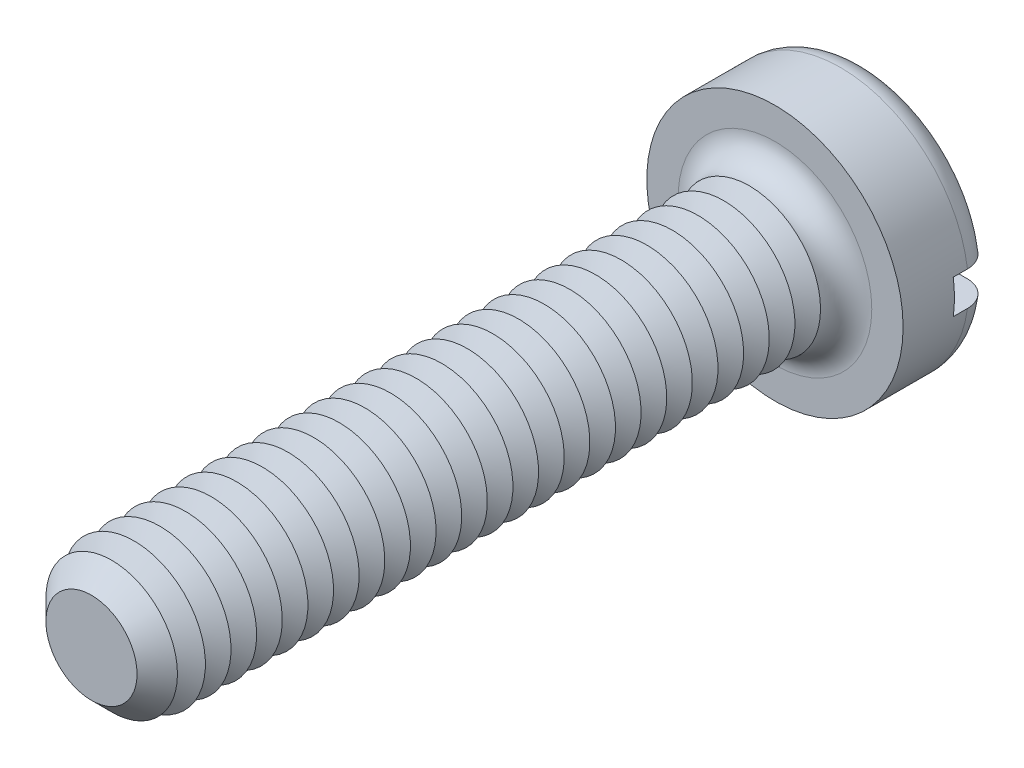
from build123d import *

# Parameters (mm, degrees)
SKETCH3_R           = 2.25
BOSS_EXTRUDE2_DEPTH = 1.6
SKETCH4_R           = 1.25
BOSS_EXTRUDE3_DEPTH = 12
FILLET1_R           = 0.45
CHAMFER1_SIZE       = 0.45
LPATTERN1_COUNT     = 25
LPATTERN1_PITCH     = 0.45
SKETCH8_W           = 4.5
SKETCH8_H           = 0.6
CUT_EXTRUDE1_DEPTH  = 0.7


with BuildPart() as part:
    # Sketch3 → Boss-Extrude2 (new body)
    with BuildSketch(Plane.XY):
        Circle(SKETCH3_R)
    extrude(amount=-BOSS_EXTRUDE2_DEPTH)

    # Sketch4 → Boss-Extrude3 (add)
    with BuildSketch(Plane.XY):
        Circle(SKETCH4_R)
    extrude(amount=BOSS_EXTRUDE3_DEPTH)

    # Fillet1
    fillet1_edges = [part.edges().sort_by_distance(p)[0] for p in [
        (-2.25, 0, -1.6),
        (-1.25, 0, 0),
    ]]
    fillet(fillet1_edges, radius=FILLET1_R)

    # Chamfer1
    chamfer1_edges = [part.edges().sort_by_distance(p)[0] for p in [
        (-1.25, 0, 12),
    ]]
    chamfer(chamfer1_edges, length=CHAMFER1_SIZE)

    # Sketch6 → Cut-Revolve1 (revolve, cut)
    with BuildSketch(Plane(origin=(0, 0, 0), x_dir=(0, 0, -1), z_dir=(1, 0, 0)), mode=Mode.PRIVATE) as cut_revolve1_sk:
        Polygon((-0.45, 1.25), (-0.675, 0.860288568), (-0.9, 1.25), align=None)
    cut_revolve1 = revolve(cut_revolve1_sk.sketch.rotate(Axis((0, 0, -1.694361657), (0, 0, 1)), 90), axis=Axis((0, 0, -1.694361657), (0, 0, 1)), mode=Mode.SUBTRACT)

    # LPattern1: Cut-Revolve1 ×25
    with Locations(*[(0, 0, i * LPATTERN1_PITCH) for i in range(1, LPATTERN1_COUNT)]):
        add(cut_revolve1, mode=Mode.SUBTRACT)

    # Sketch8 → Cut-Extrude1 (cut)
    with BuildSketch(Plane(origin=(0, 0, -1.6), x_dir=(-1, 0, 0), z_dir=(0, 0, -1))):
        Rectangle(SKETCH8_W, SKETCH8_H)
    extrude(amount=-CUT_EXTRUDE1_DEPTH, mode=Mode.SUBTRACT)


solid = part.part
